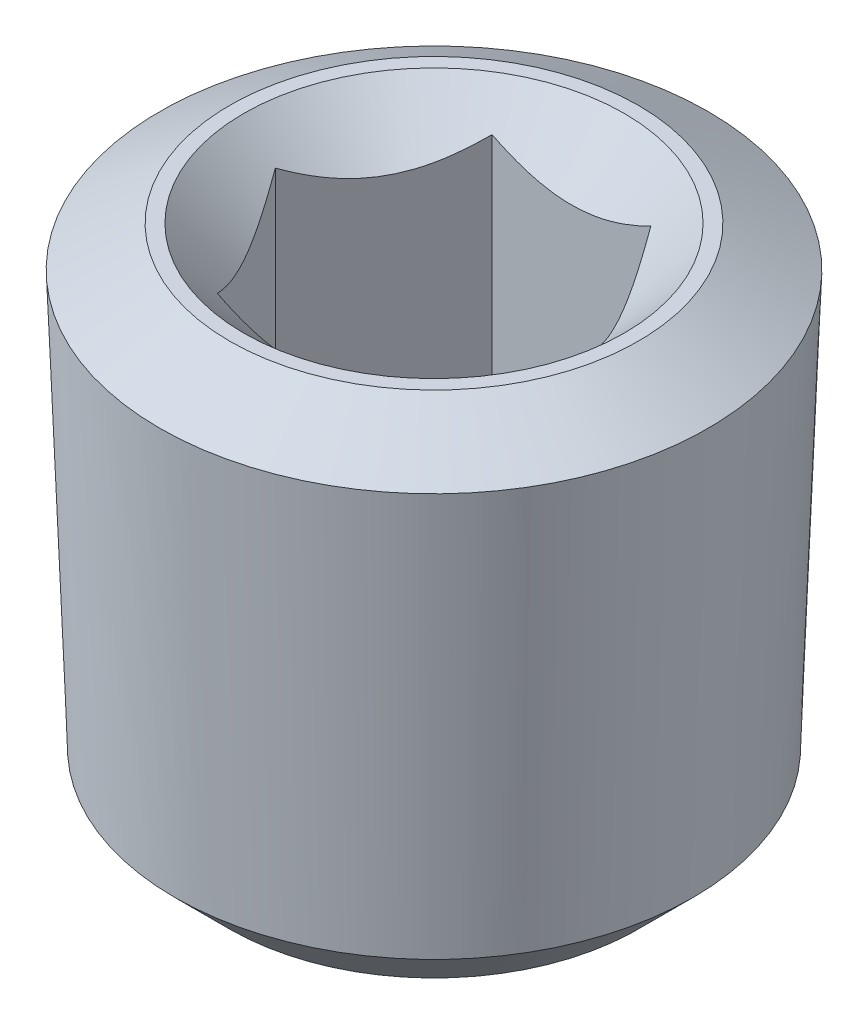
from build123d import *

# Parameters (mm, degrees)
CUT_EXTRUDE1_START = -6.096
CUT_EXTRUDE1_DEPTH = 5.640493


with BuildPart() as part:
    # Sketch2 → Revolve1 (revolve)
    with BuildSketch(Plane.XY, mode=Mode.PRIVATE) as revolve1_sk:
        Polygon((0, 0), (-2.945471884, 0), (-3.953873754, -0.582201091), (-3.736304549, -6.549767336), (-2.945471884, -7.3406), (0, -7.3406), align=None)
    revolve(revolve1_sk.sketch.rotate(Axis((0, 10.744282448, 0), (0, -1, 0)), 270), axis=Axis((0, 10.744282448, 0), (0, -1, 0)))

    # Sketch3 → Cut-Revolve1 (revolve, cut)
    with BuildSketch(Plane.XY, mode=Mode.PRIVATE) as cut_revolve1_sk:
        Polygon((0, 0), (-2.7432, 0), (-1.9812, -0.762), (-1.9812, -6.096), (-1.558473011, -6.35), (0, -6.35), align=None)
    revolve(cut_revolve1_sk.sketch.rotate(Axis((0, 2.934222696, 0), (0, -1, 0)), 270), axis=Axis((0, 2.934222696, 0), (0, -1, 0)), mode=Mode.SUBTRACT)

    # Sketch4 → Cut-Extrude1 (cut)
    with BuildSketch(Plane(origin=(0, 0, 0), x_dir=(1, 0, 0), z_dir=(0, 1, 0)).offset(CUT_EXTRUDE1_START)):
        Polygon((-1.143846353, -1.9812), (1.143846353, -1.9812), (2.287692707, 0), (1.143846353, 1.9812), (-1.143846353, 1.9812), (-2.287692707, 0), align=None)
    extrude(amount=CUT_EXTRUDE1_DEPTH, mode=Mode.SUBTRACT)


solid = part.part
